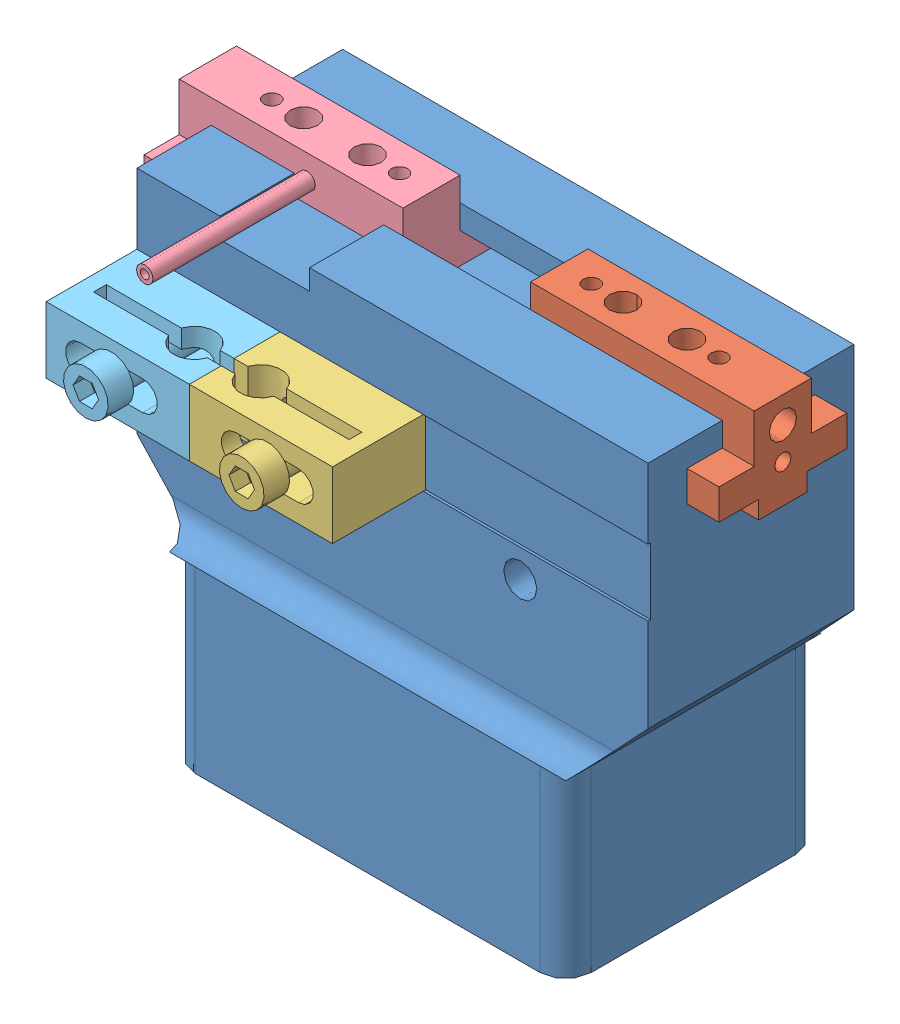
SolidWorks assembly agpt-500.sldasm, configuration OPEN (file format 6000). Lengths in mm.
Overall size (57.15 49.12 34.48).
5 component instances, 5 part files, 15 mates.
Components (placement in the parent):
- RPG25B-1: RPG25B.sldprt [Default] at (18.91 0.47 9.76) x (1 0 0) z (0 1 0) size (50.8 25.4 46.74)
- RPG25G2-1: RPG25G2.sldprt [Default] at (17.4625 43.688 0) x (1 0 0) z (0 1 0) size (22.23 12.7 10.87)
- RPG25S2-1: RPG25S2.sldprt [Default] at (-4.064 36.449 14.2875) x (1 0 0) z (0 1 0) size (14.22 14.99 6.6)
- RPG25G-1: RPG25G.sldprt [Default] at (-17.4625 43.688 6.3119) x (1 0 0) z (0 1 0) size (22.23 25.32 10.87)
- RPG25S1-1: RPG25S1.sldprt [Default] at (-18.288 36.449 14.2875) x (1 0 0) z (0 1 0) size (14.22 14.99 6.6)
Mates (geometry in assembly coordinates):
- Distance1: distance = 2.3876 mm aligned: plane of RPG25B-1 through (0 46.736 0) normal (0 1 0); plane of RPG25G2-1 through (17.526 49.1236 0) normal (0 1 0)
- Coincident1: coincident anti-aligned: plane of RPG25B-1 through (28.575 44.3484 -2.8448) normal (0 0 1); plane of RPG25G2-1 through (6.35 44.3484 -2.8448) normal (0 0 -1)
- Coincident2: coincident anti-aligned: plane of RPG25B-1 through (28.575 44.3484 -2.8448) normal (0 0 1); plane of RPG25G-1 through (-28.702 44.3484 -2.8448) normal (0 0 -1)
- Coincident3: coincident anti-aligned: plane of RPG25B-1 through (0 36.449 9.9695) normal (0 0 1); plane of RPG25S2-1 through (3.048 39.751 9.9695) normal (0 0 -1)
- Coincident4: coincident anti-aligned: plane of RPG25B-1 through (0 36.449 9.9695) normal (0 0 1); plane of RPG25S1-1 through (-25.4 33.147 9.9695) normal (0 0 -1)
- Concentric1: concentric aligned: cylinder of RPG25B-1 through (-3.429 36.449 6.7945) axis (0 0 1) radius 1.397; cylinder of RPG25S2-1 through (-3.429 36.449 6.7945) axis (0 0 1) radius 1.397
- Concentric2: concentric aligned: cylinder of RPG25B-1 through (-18.923 36.449 6.7945) axis (0 0 1) radius 1.397; cylinder of RPG25S1-1 through (-18.923 36.449 6.7945) axis (0 0 1) radius 1.397
- Coincident5: coincident aligned: plane of RPG25S2-1 through (-4.2325 39.751 14.9123) normal (0 1 0); plane of RPG25S1-1 through (-18.1195 39.751 14.9123) normal (0 1 0)
- Coincident6: coincident anti-aligned: plane of RPG25B-1 through (0 0 0) normal (0 -1 0); plane of assembly through (0 0 0) normal (0 1 0)
- Symmetric1: symmetric aligned: plane of RPG25B-1 through (17.145 0 12.7) normal (0 0 1); plane of RPG25B-1 through (-17.145 0 -12.7) normal (0 0 -1); plane of assembly through (0 0 0) normal (0 0 1)
- Symmetric2: symmetric aligned: plane of RPG25B-1 through (19.685 0 -10.16) normal (1 0 0); plane of RPG25B-1 through (-19.685 0 10.16) normal (-1 0 0); plane of assembly through (0 0 0) normal (1 0 0)
- Coincident7: coincident aligned: plane of RPG25G2-1 through (17.526 49.1236 0) normal (0 1 0); plane of RPG25G-1 through (-17.526 49.1236 0) normal (0 1 0)
- Symmetric3: symmetric aligned: plane of RPG25G2-1 through (6.35 44.3484 2.8448) normal (-1 0 0); plane of RPG25G-1 through (-6.35 44.3484 -2.8448) normal (1 0 0); plane of assembly through (0 0 0) normal (1 0 0)
- Coincident8: coincident anti-aligned: plane of RPG25G2-1 through (0 44.3484 2.8448) normal (-1 0 0); plane of RPG25G-1 through (0 44.3484 -2.8448) normal (1 0 0)
- Distance2: distance = 57.15 mm anti-aligned: plane of RPG25G-1 through (-28.575 43.8863 0) normal (-1 0 0); plane of RPG25G2-1 through (28.575 43.8863 0) normal (1 0 0)
